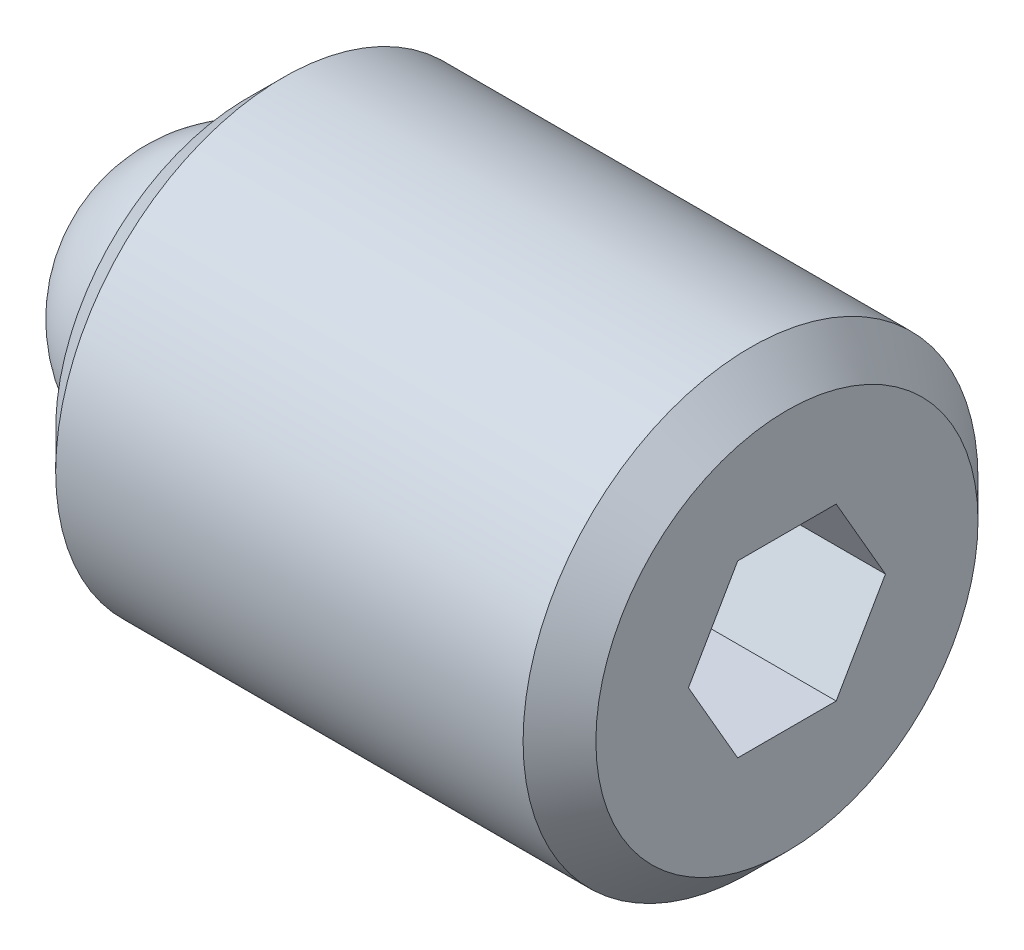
from build123d import *

# Parameters (mm, degrees)
SKETCH2_R           = 3.175
BOSS_EXTRUDE1_DEPTH = 7.540625
CHAMFER1_SIZE       = 0.508
CHAMFER2_SIZE       = 0.508
CUT_EXTRUDE2_DEPTH  = 2.286
SKETCH3_R           = 1.9812
CUT_EXTRUDE3_DEPTH  = 1.984375


with BuildPart() as part:
    # Sketch2 → Boss-Extrude1 (new body)
    with BuildSketch(Plane(origin=(0, 0, 0), x_dir=(0, 0, -1), z_dir=(1, 0, 0))):
        with Locations(Location((0, 0, 0), (0, 0, 180))):
            Circle(SKETCH2_R)
    extrude(amount=BOSS_EXTRUDE1_DEPTH)

    # Chamfer1
    chamfer1_edges = [part.edges().sort_by_distance(p)[0] for p in [
        (0, 0, -3.175),
    ]]
    chamfer(chamfer1_edges, length=CHAMFER1_SIZE)

    # Chamfer2
    chamfer2_edges = [part.edges().sort_by_distance(p)[0] for p in [
        (7.540625, 0, -3.175),
    ]]
    chamfer(chamfer2_edges, length=CHAMFER2_SIZE)

    # Sketch4 → Cut-Extrude2 (cut)
    with BuildSketch(Plane(origin=(7.540625, 0, 0), x_dir=(0, 0, -1), z_dir=(1, 0, 0))):
        Polygon((1.374815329, 0), (0.687407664, 1.190625), (-0.687407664, 1.190625), (-1.374815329, 0), (-0.687407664, -1.190625), (0.687407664, -1.190625), align=None)
    extrude(amount=-CUT_EXTRUDE2_DEPTH, mode=Mode.SUBTRACT)

    # Sketch3 → Cut-Extrude3 (cut)
    with BuildSketch(Plane.ZY):
        Circle(SKETCH3_R)
    extrude(amount=-CUT_EXTRUDE3_DEPTH, mode=Mode.SUBTRACT)


with BuildPart() as body_2:
    # Sketch5 → Revolve1 (revolve)
    with BuildSketch(Plane.ZY):
        with BuildLine():
            Line((0, 0), (0, -1.984375))
            ThreePointArc((0, -1.984375), (-1.984375, 0), (0, 1.984375))
            Line((0, 1.984375), (0, 0))
        make_face()
    revolve(axis=Axis((0, 0, 0), (0, 1, 0)))


solid = Compound([part.part, body_2.part])
